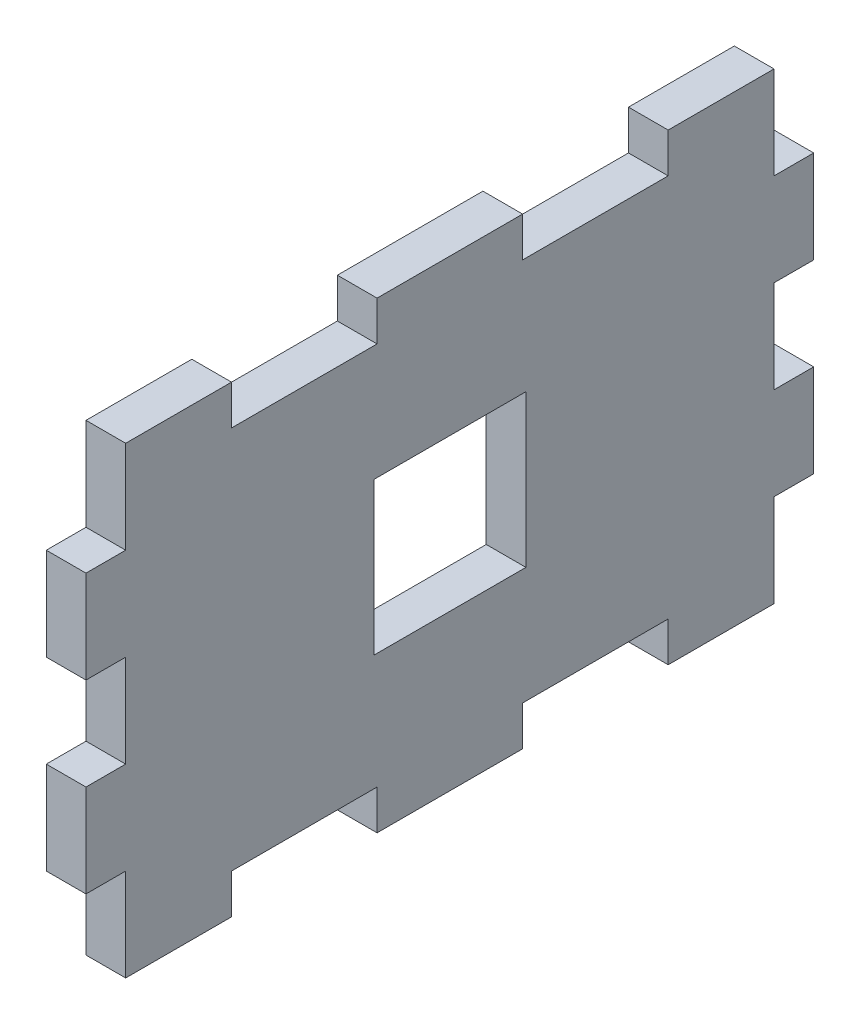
ISO-10303-21;
HEADER;
FILE_DESCRIPTION(('STEP AP214'),'2;1');
FILE_NAME('part.step','',(''),(''),'','','');
FILE_SCHEMA(('AUTOMOTIVE_DESIGN { 1 0 10303 214 1 1 1 1 }'));
ENDSEC;
DATA;
#1=APPLICATION_CONTEXT('core data for automotive mechanical design processes');
#2=APPLICATION_PROTOCOL_DEFINITION('international standard','automotive_design',2000,#1);
#3=PRODUCT_CONTEXT('',#1,'mechanical');
#4=PRODUCT('Part','Part','',(#3));
#5=PRODUCT_RELATED_PRODUCT_CATEGORY('part','',(#4));
#6=PRODUCT_DEFINITION_FORMATION('','',#4);
#7=PRODUCT_DEFINITION_CONTEXT('part definition',#1,'design');
#8=PRODUCT_DEFINITION('design','',#6,#7);
#9=PRODUCT_DEFINITION_SHAPE('','',#8);
#10=(LENGTH_UNIT() NAMED_UNIT(*) SI_UNIT(.MILLI.,.METRE.));
#11=(NAMED_UNIT(*) PLANE_ANGLE_UNIT() SI_UNIT($,.RADIAN.));
#12=(NAMED_UNIT(*) SI_UNIT($,.STERADIAN.) SOLID_ANGLE_UNIT());
#13=UNCERTAINTY_MEASURE_WITH_UNIT(LENGTH_MEASURE(1.E-05),#10,'distance_accuracy_value','');
#14=(GEOMETRIC_REPRESENTATION_CONTEXT(3) GLOBAL_UNCERTAINTY_ASSIGNED_CONTEXT((#13)) GLOBAL_UNIT_ASSIGNED_CONTEXT((#10,
#11,#12)) REPRESENTATION_CONTEXT('',''));
#15=CARTESIAN_POINT('',(0.,0.,0.));
#16=DIRECTION('',(0.,0.,1.));
#17=DIRECTION('',(1.,0.,0.));
#18=AXIS2_PLACEMENT_3D('',#15,#16,#17);
#19=CARTESIAN_POINT('',(3.,0.,0.));
#20=DIRECTION('',(1.,0.,0.));
#21=DIRECTION('',(0.,0.,-1.));
#22=AXIS2_PLACEMENT_3D('',#19,#20,#21);
#23=PLANE('',#22);
#24=DIRECTION('',(0.,1.,0.));
#25=VECTOR('',#24,1.);
#26=CARTESIAN_POINT('',(3.,5.75,-5.75));
#27=LINE('',#26,#25);
#28=CARTESIAN_POINT('',(3.,-5.75,-5.75));
#29=VERTEX_POINT('',#28);
#30=CARTESIAN_POINT('',(3.,5.75,-5.75));
#31=VERTEX_POINT('',#30);
#32=EDGE_CURVE('E49',#29,#31,#27,.T.);
#33=ORIENTED_EDGE('',*,*,#32,.F.);
#34=DIRECTION('',(0.,0.,-1.));
#35=VECTOR('',#34,1.);
#36=CARTESIAN_POINT('',(3.,-5.75,5.75));
#37=LINE('',#36,#35);
#38=CARTESIAN_POINT('',(3.,-5.75,5.75));
#39=VERTEX_POINT('',#38);
#40=EDGE_CURVE('E309',#39,#29,#37,.T.);
#41=ORIENTED_EDGE('',*,*,#40,.F.);
#42=DIRECTION('',(0.,-1.,0.));
#43=VECTOR('',#42,1.);
#44=CARTESIAN_POINT('',(3.,5.75,5.75));
#45=LINE('',#44,#43);
#46=CARTESIAN_POINT('',(3.,5.75,5.75));
#47=VERTEX_POINT('',#46);
#48=EDGE_CURVE('E294',#47,#39,#45,.T.);
#49=ORIENTED_EDGE('',*,*,#48,.F.);
#50=DIRECTION('',(0.,0.,1.));
#51=VECTOR('',#50,1.);
#52=CARTESIAN_POINT('',(3.,5.75,5.75));
#53=LINE('',#52,#51);
#54=EDGE_CURVE('E303',#31,#47,#53,.T.);
#55=ORIENTED_EDGE('',*,*,#54,.F.);
#56=EDGE_LOOP('',(#33,#41,#49,#55));
#57=FACE_BOUND('',#56,.T.);
#58=DIRECTION('',(0.,-1.,0.));
#59=VECTOR('',#58,1.);
#60=CARTESIAN_POINT('',(3.,0.,24.5));
#61=LINE('',#60,#59);
#62=CARTESIAN_POINT('',(3.,3.5,24.5));
#63=VERTEX_POINT('',#62);
#64=CARTESIAN_POINT('',(3.,-3.5,24.5));
#65=VERTEX_POINT('',#64);
#66=EDGE_CURVE('E333',#63,#65,#61,.T.);
#67=ORIENTED_EDGE('',*,*,#66,.T.);
#68=DIRECTION('',(0.,0.,1.));
#69=VECTOR('',#68,1.);
#70=CARTESIAN_POINT('',(3.,-3.5,0.));
#71=LINE('',#70,#69);
#72=CARTESIAN_POINT('',(3.,-3.5,27.5));
#73=VERTEX_POINT('',#72);
#74=EDGE_CURVE('E337',#65,#73,#71,.T.);
#75=ORIENTED_EDGE('',*,*,#74,.T.);
#76=DIRECTION('',(0.,-1.,0.));
#77=VECTOR('',#76,1.);
#78=CARTESIAN_POINT('',(3.,17.5,27.5));
#79=LINE('',#78,#77);
#80=CARTESIAN_POINT('',(3.,-10.5,27.5));
#81=VERTEX_POINT('',#80);
#82=EDGE_CURVE('E552',#73,#81,#79,.T.);
#83=ORIENTED_EDGE('',*,*,#82,.T.);
#84=DIRECTION('',(0.,0.,-1.));
#85=VECTOR('',#84,1.);
#86=CARTESIAN_POINT('',(3.,-10.5,0.));
#87=LINE('',#86,#85);
#88=CARTESIAN_POINT('',(3.,-10.5,24.5));
#89=VERTEX_POINT('',#88);
#90=EDGE_CURVE('E354',#81,#89,#87,.T.);
#91=ORIENTED_EDGE('',*,*,#90,.T.);
#92=DIRECTION('',(0.,-1.,0.));
#93=VECTOR('',#92,1.);
#94=CARTESIAN_POINT('',(3.,0.,24.5));
#95=LINE('',#94,#93);
#96=CARTESIAN_POINT('',(3.,-17.5,24.5));
#97=VERTEX_POINT('',#96);
#98=EDGE_CURVE('E329',#89,#97,#95,.T.);
#99=ORIENTED_EDGE('',*,*,#98,.T.);
#100=DIRECTION('',(0.,0.,-1.));
#101=VECTOR('',#100,1.);
#102=CARTESIAN_POINT('',(3.,-17.5,27.5));
#103=LINE('',#102,#101);
#104=CARTESIAN_POINT('',(3.,-17.5,16.5));
#105=VERTEX_POINT('',#104);
#106=EDGE_CURVE('E559',#97,#105,#103,.T.);
#107=ORIENTED_EDGE('',*,*,#106,.T.);
#108=DIRECTION('',(0.,1.,0.));
#109=VECTOR('',#108,1.);
#110=CARTESIAN_POINT('',(3.,0.,16.5));
#111=LINE('',#110,#109);
#112=CARTESIAN_POINT('',(3.,-14.5,16.5));
#113=VERTEX_POINT('',#112);
#114=EDGE_CURVE('E434',#105,#113,#111,.T.);
#115=ORIENTED_EDGE('',*,*,#114,.T.);
#116=DIRECTION('',(0.,0.,-1.));
#117=VECTOR('',#116,1.);
#118=CARTESIAN_POINT('',(3.,-14.5,0.));
#119=LINE('',#118,#117);
#120=CARTESIAN_POINT('',(3.,-14.5,5.5));
#121=VERTEX_POINT('',#120);
#122=EDGE_CURVE('E497',#113,#121,#119,.T.);
#123=ORIENTED_EDGE('',*,*,#122,.T.);
#124=DIRECTION('',(0.,-1.,0.));
#125=VECTOR('',#124,1.);
#126=CARTESIAN_POINT('',(3.,0.,5.5));
#127=LINE('',#126,#125);
#128=CARTESIAN_POINT('',(3.,-17.5,5.5));
#129=VERTEX_POINT('',#128);
#130=EDGE_CURVE('E505',#121,#129,#127,.T.);
#131=ORIENTED_EDGE('',*,*,#130,.T.);
#132=CARTESIAN_POINT('',(3.,-17.5,-5.5));
#133=VERTEX_POINT('',#132);
#134=EDGE_CURVE('E562',#129,#133,#103,.T.);
#135=ORIENTED_EDGE('',*,*,#134,.T.);
#136=DIRECTION('',(0.,1.,0.));
#137=VECTOR('',#136,1.);
#138=CARTESIAN_POINT('',(3.,0.,-5.5));
#139=LINE('',#138,#137);
#140=CARTESIAN_POINT('',(3.,-14.5,-5.5));
#141=VERTEX_POINT('',#140);
#142=EDGE_CURVE('E477',#133,#141,#139,.T.);
#143=ORIENTED_EDGE('',*,*,#142,.T.);
#144=DIRECTION('',(0.,0.,-1.));
#145=VECTOR('',#144,1.);
#146=CARTESIAN_POINT('',(3.,-14.5,0.));
#147=LINE('',#146,#145);
#148=CARTESIAN_POINT('',(3.,-14.5,-16.5));
#149=VERTEX_POINT('',#148);
#150=EDGE_CURVE('E471',#141,#149,#147,.T.);
#151=ORIENTED_EDGE('',*,*,#150,.T.);
#152=DIRECTION('',(0.,-1.,0.));
#153=VECTOR('',#152,1.);
#154=CARTESIAN_POINT('',(3.,0.,-16.5));
#155=LINE('',#154,#153);
#156=CARTESIAN_POINT('',(3.,-17.5,-16.5));
#157=VERTEX_POINT('',#156);
#158=EDGE_CURVE('E480',#149,#157,#155,.T.);
#159=ORIENTED_EDGE('',*,*,#158,.T.);
#160=CARTESIAN_POINT('',(3.,-17.5,-24.5));
#161=VERTEX_POINT('',#160);
#162=EDGE_CURVE('E558',#157,#161,#103,.T.);
#163=ORIENTED_EDGE('',*,*,#162,.T.);
#164=DIRECTION('',(0.,-1.,0.));
#165=VECTOR('',#164,1.);
#166=CARTESIAN_POINT('',(3.,0.,-24.5));
#167=LINE('',#166,#165);
#168=CARTESIAN_POINT('',(3.,-10.5,-24.5));
#169=VERTEX_POINT('',#168);
#170=EDGE_CURVE('E413',#169,#161,#167,.T.);
#171=ORIENTED_EDGE('',*,*,#170,.F.);
#172=DIRECTION('',(0.,0.,1.));
#173=VECTOR('',#172,1.);
#174=CARTESIAN_POINT('',(3.,-10.5,0.));
#175=LINE('',#174,#173);
#176=CARTESIAN_POINT('',(3.,-10.5,-27.5));
#177=VERTEX_POINT('',#176);
#178=EDGE_CURVE('E390',#177,#169,#175,.T.);
#179=ORIENTED_EDGE('',*,*,#178,.F.);
#180=DIRECTION('',(0.,1.,0.));
#181=VECTOR('',#180,1.);
#182=CARTESIAN_POINT('',(3.,17.5,-27.5));
#183=LINE('',#182,#181);
#184=CARTESIAN_POINT('',(3.,-3.5,-27.5));
#185=VERTEX_POINT('',#184);
#186=EDGE_CURVE('E548',#177,#185,#183,.T.);
#187=ORIENTED_EDGE('',*,*,#186,.T.);
#188=DIRECTION('',(0.,0.,-1.));
#189=VECTOR('',#188,1.);
#190=CARTESIAN_POINT('',(3.,-3.49999999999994,0.));
#191=LINE('',#190,#189);
#192=CARTESIAN_POINT('',(3.,-3.5,-24.5));
#193=VERTEX_POINT('',#192);
#194=EDGE_CURVE('E391',#193,#185,#191,.T.);
#195=ORIENTED_EDGE('',*,*,#194,.F.);
#196=DIRECTION('',(0.,-1.,0.));
#197=VECTOR('',#196,1.);
#198=CARTESIAN_POINT('',(3.,0.,-24.5));
#199=LINE('',#198,#197);
#200=CARTESIAN_POINT('',(3.,3.5,-24.5));
#201=VERTEX_POINT('',#200);
#202=EDGE_CURVE('E393',#201,#193,#199,.T.);
#203=ORIENTED_EDGE('',*,*,#202,.F.);
#204=DIRECTION('',(0.,0.,1.));
#205=VECTOR('',#204,1.);
#206=CARTESIAN_POINT('',(3.,3.50000000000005,0.));
#207=LINE('',#206,#205);
#208=CARTESIAN_POINT('',(3.,3.5,-27.5));
#209=VERTEX_POINT('',#208);
#210=EDGE_CURVE('E370',#209,#201,#207,.T.);
#211=ORIENTED_EDGE('',*,*,#210,.F.);
#212=CARTESIAN_POINT('',(3.,10.5,-27.5));
#213=VERTEX_POINT('',#212);
#214=EDGE_CURVE('E545',#209,#213,#183,.T.);
#215=ORIENTED_EDGE('',*,*,#214,.T.);
#216=DIRECTION('',(0.,0.,-1.));
#217=VECTOR('',#216,1.);
#218=CARTESIAN_POINT('',(3.,10.5,0.));
#219=LINE('',#218,#217);
#220=CARTESIAN_POINT('',(3.,10.5,-24.5));
#221=VERTEX_POINT('',#220);
#222=EDGE_CURVE('E371',#221,#213,#219,.T.);
#223=ORIENTED_EDGE('',*,*,#222,.F.);
#224=DIRECTION('',(0.,-1.,0.));
#225=VECTOR('',#224,1.);
#226=CARTESIAN_POINT('',(3.,0.,-24.5));
#227=LINE('',#226,#225);
#228=CARTESIAN_POINT('',(3.,17.5,-24.5));
#229=VERTEX_POINT('',#228);
#230=EDGE_CURVE('E353',#229,#221,#227,.T.);
#231=ORIENTED_EDGE('',*,*,#230,.F.);
#232=DIRECTION('',(0.,0.,1.));
#233=VECTOR('',#232,1.);
#234=CARTESIAN_POINT('',(3.,17.5,27.5));
#235=LINE('',#234,#233);
#236=CARTESIAN_POINT('',(3.,17.5,-16.5));
#237=VERTEX_POINT('',#236);
#238=EDGE_CURVE('E550',#229,#237,#235,.T.);
#239=ORIENTED_EDGE('',*,*,#238,.T.);
#240=DIRECTION('',(0.,1.,0.));
#241=VECTOR('',#240,1.);
#242=CARTESIAN_POINT('',(3.,0.,-16.5));
#243=LINE('',#242,#241);
#244=CARTESIAN_POINT('',(3.,14.5,-16.5));
#245=VERTEX_POINT('',#244);
#246=EDGE_CURVE('E453',#245,#237,#243,.T.);
#247=ORIENTED_EDGE('',*,*,#246,.F.);
#248=DIRECTION('',(0.,0.,-1.));
#249=VECTOR('',#248,1.);
#250=CARTESIAN_POINT('',(3.,14.5,0.));
#251=LINE('',#250,#249);
#252=CARTESIAN_POINT('',(3.,14.5,-5.5));
#253=VERTEX_POINT('',#252);
#254=EDGE_CURVE('E450',#253,#245,#251,.T.);
#255=ORIENTED_EDGE('',*,*,#254,.F.);
#256=DIRECTION('',(0.,-1.,0.));
#257=VECTOR('',#256,1.);
#258=CARTESIAN_POINT('',(3.,0.,-5.5));
#259=LINE('',#258,#257);
#260=CARTESIAN_POINT('',(3.,17.5,-5.5));
#261=VERTEX_POINT('',#260);
#262=EDGE_CURVE('E443',#261,#253,#259,.T.);
#263=ORIENTED_EDGE('',*,*,#262,.F.);
#264=CARTESIAN_POINT('',(3.,17.5,5.5));
#265=VERTEX_POINT('',#264);
#266=EDGE_CURVE('E553',#261,#265,#235,.T.);
#267=ORIENTED_EDGE('',*,*,#266,.T.);
#268=DIRECTION('',(0.,1.,0.));
#269=VECTOR('',#268,1.);
#270=CARTESIAN_POINT('',(3.,0.,5.5));
#271=LINE('',#270,#269);
#272=CARTESIAN_POINT('',(3.,14.5,5.5));
#273=VERTEX_POINT('',#272);
#274=EDGE_CURVE('E531',#273,#265,#271,.T.);
#275=ORIENTED_EDGE('',*,*,#274,.F.);
#276=DIRECTION('',(0.,0.,-1.));
#277=VECTOR('',#276,1.);
#278=CARTESIAN_POINT('',(3.,14.5,0.));
#279=LINE('',#278,#277);
#280=CARTESIAN_POINT('',(3.,14.5,16.5));
#281=VERTEX_POINT('',#280);
#282=EDGE_CURVE('E461',#281,#273,#279,.T.);
#283=ORIENTED_EDGE('',*,*,#282,.F.);
#284=DIRECTION('',(0.,-1.,0.));
#285=VECTOR('',#284,1.);
#286=CARTESIAN_POINT('',(3.,0.,16.5));
#287=LINE('',#286,#285);
#288=CARTESIAN_POINT('',(3.,17.5,16.5));
#289=VERTEX_POINT('',#288);
#290=EDGE_CURVE('E522',#289,#281,#287,.T.);
#291=ORIENTED_EDGE('',*,*,#290,.F.);
#292=CARTESIAN_POINT('',(3.,17.5,24.5));
#293=VERTEX_POINT('',#292);
#294=EDGE_CURVE('E554',#289,#293,#235,.T.);
#295=ORIENTED_EDGE('',*,*,#294,.T.);
#296=DIRECTION('',(0.,-1.,0.));
#297=VECTOR('',#296,1.);
#298=CARTESIAN_POINT('',(3.,0.,24.5));
#299=LINE('',#298,#297);
#300=CARTESIAN_POINT('',(3.,10.5,24.5));
#301=VERTEX_POINT('',#300);
#302=EDGE_CURVE('E425',#293,#301,#299,.T.);
#303=ORIENTED_EDGE('',*,*,#302,.T.);
#304=DIRECTION('',(0.,0.,1.));
#305=VECTOR('',#304,1.);
#306=CARTESIAN_POINT('',(3.,10.5,0.));
#307=LINE('',#306,#305);
#308=CARTESIAN_POINT('',(3.,10.5,27.5));
#309=VERTEX_POINT('',#308);
#310=EDGE_CURVE('E340',#301,#309,#307,.T.);
#311=ORIENTED_EDGE('',*,*,#310,.T.);
#312=CARTESIAN_POINT('',(3.,3.5,27.5));
#313=VERTEX_POINT('',#312);
#314=EDGE_CURVE('E555',#309,#313,#79,.T.);
#315=ORIENTED_EDGE('',*,*,#314,.T.);
#316=DIRECTION('',(0.,0.,-1.));
#317=VECTOR('',#316,1.);
#318=CARTESIAN_POINT('',(3.,3.5,0.));
#319=LINE('',#318,#317);
#320=EDGE_CURVE('E330',#313,#63,#319,.T.);
#321=ORIENTED_EDGE('',*,*,#320,.T.);
#322=EDGE_LOOP('',(#67,#75,#83,#91,#99,#107,#115,#123,#131,#135,#143,#151,#159,#163,#171,#179,
#187,#195,#203,#211,#215,#223,#231,#239,#247,#255,#263,#267,#275,#283,#291,#295,#303,#311,#315,#321));
#323=FACE_BOUND('',#322,.T.);
#324=ADVANCED_FACE('F34',(#57,#323),#23,.T.);
#325=CARTESIAN_POINT('',(0.,0.,0.));
#326=DIRECTION('',(1.,0.,0.));
#327=DIRECTION('',(0.,0.,-1.));
#328=AXIS2_PLACEMENT_3D('',#325,#326,#327);
#329=PLANE('',#328);
#330=DIRECTION('',(0.,0.,-1.));
#331=VECTOR('',#330,1.);
#332=CARTESIAN_POINT('',(0.,-5.75,0.));
#333=LINE('',#332,#331);
#334=CARTESIAN_POINT('',(0.,-5.75,5.75));
#335=VERTEX_POINT('',#334);
#336=CARTESIAN_POINT('',(0.,-5.75,-5.75));
#337=VERTEX_POINT('',#336);
#338=EDGE_CURVE('E42',#335,#337,#333,.T.);
#339=ORIENTED_EDGE('',*,*,#338,.T.);
#340=DIRECTION('',(0.,1.,0.));
#341=VECTOR('',#340,1.);
#342=CARTESIAN_POINT('',(0.,0.,-5.75));
#343=LINE('',#342,#341);
#344=CARTESIAN_POINT('',(0.,5.75,-5.75));
#345=VERTEX_POINT('',#344);
#346=EDGE_CURVE('E12',#337,#345,#343,.T.);
#347=ORIENTED_EDGE('',*,*,#346,.T.);
#348=DIRECTION('',(0.,0.,1.));
#349=VECTOR('',#348,1.);
#350=CARTESIAN_POINT('',(0.,5.75,0.));
#351=LINE('',#350,#349);
#352=CARTESIAN_POINT('',(0.,5.75,5.75));
#353=VERTEX_POINT('',#352);
#354=EDGE_CURVE('E561',#345,#353,#351,.T.);
#355=ORIENTED_EDGE('',*,*,#354,.T.);
#356=DIRECTION('',(0.,-1.,0.));
#357=VECTOR('',#356,1.);
#358=CARTESIAN_POINT('',(0.,0.,5.75));
#359=LINE('',#358,#357);
#360=EDGE_CURVE('E297',#353,#335,#359,.T.);
#361=ORIENTED_EDGE('',*,*,#360,.T.);
#362=EDGE_LOOP('',(#339,#347,#355,#361));
#363=FACE_BOUND('',#362,.T.);
#364=DIRECTION('',(0.,0.,1.));
#365=VECTOR('',#364,1.);
#366=CARTESIAN_POINT('',(0.,-3.5,0.));
#367=LINE('',#366,#365);
#368=CARTESIAN_POINT('',(0.,-3.5,24.5));
#369=VERTEX_POINT('',#368);
#370=CARTESIAN_POINT('',(0.,-3.5,27.5));
#371=VERTEX_POINT('',#370);
#372=EDGE_CURVE('E334',#369,#371,#367,.T.);
#373=ORIENTED_EDGE('',*,*,#372,.F.);
#374=DIRECTION('',(0.,-1.,0.));
#375=VECTOR('',#374,1.);
#376=CARTESIAN_POINT('',(0.,0.,24.5));
#377=LINE('',#376,#375);
#378=CARTESIAN_POINT('',(0.,3.5,24.5));
#379=VERTEX_POINT('',#378);
#380=EDGE_CURVE('E342',#379,#369,#377,.T.);
#381=ORIENTED_EDGE('',*,*,#380,.F.);
#382=DIRECTION('',(0.,0.,-1.));
#383=VECTOR('',#382,1.);
#384=CARTESIAN_POINT('',(0.,3.5,0.));
#385=LINE('',#384,#383);
#386=CARTESIAN_POINT('',(0.,3.5,27.5));
#387=VERTEX_POINT('',#386);
#388=EDGE_CURVE('E321',#387,#379,#385,.T.);
#389=ORIENTED_EDGE('',*,*,#388,.F.);
#390=DIRECTION('',(0.,-1.,0.));
#391=VECTOR('',#390,1.);
#392=CARTESIAN_POINT('',(0.,17.5,27.5));
#393=LINE('',#392,#391);
#394=CARTESIAN_POINT('',(0.,10.5,27.5));
#395=VERTEX_POINT('',#394);
#396=EDGE_CURVE('E571',#395,#387,#393,.T.);
#397=ORIENTED_EDGE('',*,*,#396,.F.);
#398=DIRECTION('',(0.,0.,1.));
#399=VECTOR('',#398,1.);
#400=CARTESIAN_POINT('',(0.,10.5,0.));
#401=LINE('',#400,#399);
#402=CARTESIAN_POINT('',(0.,10.5,24.5));
#403=VERTEX_POINT('',#402);
#404=EDGE_CURVE('E422',#403,#395,#401,.T.);
#405=ORIENTED_EDGE('',*,*,#404,.F.);
#406=DIRECTION('',(0.,-1.,0.));
#407=VECTOR('',#406,1.);
#408=CARTESIAN_POINT('',(0.,0.,24.5));
#409=LINE('',#408,#407);
#410=CARTESIAN_POINT('',(0.,17.5,24.5));
#411=VERTEX_POINT('',#410);
#412=EDGE_CURVE('E424',#411,#403,#409,.T.);
#413=ORIENTED_EDGE('',*,*,#412,.F.);
#414=DIRECTION('',(0.,0.,1.));
#415=VECTOR('',#414,1.);
#416=CARTESIAN_POINT('',(0.,17.5,27.5));
#417=LINE('',#416,#415);
#418=CARTESIAN_POINT('',(0.,17.5,16.5));
#419=VERTEX_POINT('',#418);
#420=EDGE_CURVE('E570',#419,#411,#417,.T.);
#421=ORIENTED_EDGE('',*,*,#420,.F.);
#422=DIRECTION('',(0.,-1.,0.));
#423=VECTOR('',#422,1.);
#424=CARTESIAN_POINT('',(0.,0.,16.5));
#425=LINE('',#424,#423);
#426=CARTESIAN_POINT('',(0.,14.5,16.5));
#427=VERTEX_POINT('',#426);
#428=EDGE_CURVE('E525',#419,#427,#425,.T.);
#429=ORIENTED_EDGE('',*,*,#428,.T.);
#430=DIRECTION('',(0.,0.,-1.));
#431=VECTOR('',#430,1.);
#432=CARTESIAN_POINT('',(0.,14.5,0.));
#433=LINE('',#432,#431);
#434=CARTESIAN_POINT('',(0.,14.5,5.5));
#435=VERTEX_POINT('',#434);
#436=EDGE_CURVE('E518',#427,#435,#433,.T.);
#437=ORIENTED_EDGE('',*,*,#436,.T.);
#438=DIRECTION('',(0.,1.,0.));
#439=VECTOR('',#438,1.);
#440=CARTESIAN_POINT('',(0.,0.,5.5));
#441=LINE('',#440,#439);
#442=CARTESIAN_POINT('',(0.,17.5,5.5));
#443=VERTEX_POINT('',#442);
#444=EDGE_CURVE('E521',#435,#443,#441,.T.);
#445=ORIENTED_EDGE('',*,*,#444,.T.);
#446=CARTESIAN_POINT('',(0.,17.5,-5.5));
#447=VERTEX_POINT('',#446);
#448=EDGE_CURVE('E569',#447,#443,#417,.T.);
#449=ORIENTED_EDGE('',*,*,#448,.F.);
#450=DIRECTION('',(0.,-1.,0.));
#451=VECTOR('',#450,1.);
#452=CARTESIAN_POINT('',(0.,0.,-5.5));
#453=LINE('',#452,#451);
#454=CARTESIAN_POINT('',(0.,14.5,-5.5));
#455=VERTEX_POINT('',#454);
#456=EDGE_CURVE('E446',#447,#455,#453,.T.);
#457=ORIENTED_EDGE('',*,*,#456,.T.);
#458=DIRECTION('',(0.,0.,-1.));
#459=VECTOR('',#458,1.);
#460=CARTESIAN_POINT('',(0.,14.5,0.));
#461=LINE('',#460,#459);
#462=CARTESIAN_POINT('',(0.,14.5,-16.5));
#463=VERTEX_POINT('',#462);
#464=EDGE_CURVE('E439',#455,#463,#461,.T.);
#465=ORIENTED_EDGE('',*,*,#464,.T.);
#466=DIRECTION('',(0.,1.,0.));
#467=VECTOR('',#466,1.);
#468=CARTESIAN_POINT('',(0.,0.,-16.5));
#469=LINE('',#468,#467);
#470=CARTESIAN_POINT('',(0.,17.5,-16.5));
#471=VERTEX_POINT('',#470);
#472=EDGE_CURVE('E442',#463,#471,#469,.T.);
#473=ORIENTED_EDGE('',*,*,#472,.T.);
#474=CARTESIAN_POINT('',(0.,17.5,-24.5));
#475=VERTEX_POINT('',#474);
#476=EDGE_CURVE('E566',#475,#471,#417,.T.);
#477=ORIENTED_EDGE('',*,*,#476,.F.);
#478=DIRECTION('',(0.,-1.,0.));
#479=VECTOR('',#478,1.);
#480=CARTESIAN_POINT('',(0.,0.,-24.5));
#481=LINE('',#480,#479);
#482=CARTESIAN_POINT('',(0.,10.5,-24.5));
#483=VERTEX_POINT('',#482);
#484=EDGE_CURVE('E373',#475,#483,#481,.T.);
#485=ORIENTED_EDGE('',*,*,#484,.T.);
#486=DIRECTION('',(0.,0.,-1.));
#487=VECTOR('',#486,1.);
#488=CARTESIAN_POINT('',(0.,10.5,0.));
#489=LINE('',#488,#487);
#490=CARTESIAN_POINT('',(0.,10.5,-27.5));
#491=VERTEX_POINT('',#490);
#492=EDGE_CURVE('E364',#483,#491,#489,.T.);
#493=ORIENTED_EDGE('',*,*,#492,.T.);
#494=DIRECTION('',(0.,1.,0.));
#495=VECTOR('',#494,1.);
#496=CARTESIAN_POINT('',(0.,17.5,-27.5));
#497=LINE('',#496,#495);
#498=CARTESIAN_POINT('',(0.,3.5,-27.5));
#499=VERTEX_POINT('',#498);
#500=EDGE_CURVE('E538',#499,#491,#497,.T.);
#501=ORIENTED_EDGE('',*,*,#500,.F.);
#502=DIRECTION('',(0.,0.,1.));
#503=VECTOR('',#502,1.);
#504=CARTESIAN_POINT('',(0.,3.50000000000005,0.));
#505=LINE('',#504,#503);
#506=CARTESIAN_POINT('',(0.,3.5,-24.5));
#507=VERTEX_POINT('',#506);
#508=EDGE_CURVE('E394',#499,#507,#505,.T.);
#509=ORIENTED_EDGE('',*,*,#508,.T.);
#510=DIRECTION('',(0.,-1.,0.));
#511=VECTOR('',#510,1.);
#512=CARTESIAN_POINT('',(0.,0.,-24.5));
#513=LINE('',#512,#511);
#514=CARTESIAN_POINT('',(0.,-3.5,-24.5));
#515=VERTEX_POINT('',#514);
#516=EDGE_CURVE('E401',#507,#515,#513,.T.);
#517=ORIENTED_EDGE('',*,*,#516,.T.);
#518=DIRECTION('',(0.,0.,-1.));
#519=VECTOR('',#518,1.);
#520=CARTESIAN_POINT('',(0.,-3.49999999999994,0.));
#521=LINE('',#520,#519);
#522=CARTESIAN_POINT('',(0.,-3.5,-27.5));
#523=VERTEX_POINT('',#522);
#524=EDGE_CURVE('E382',#515,#523,#521,.T.);
#525=ORIENTED_EDGE('',*,*,#524,.T.);
#526=CARTESIAN_POINT('',(0.,-10.5,-27.5));
#527=VERTEX_POINT('',#526);
#528=EDGE_CURVE('E565',#527,#523,#497,.T.);
#529=ORIENTED_EDGE('',*,*,#528,.F.);
#530=DIRECTION('',(0.,0.,1.));
#531=VECTOR('',#530,1.);
#532=CARTESIAN_POINT('',(0.,-10.5,0.));
#533=LINE('',#532,#531);
#534=CARTESIAN_POINT('',(0.,-10.5,-24.5));
#535=VERTEX_POINT('',#534);
#536=EDGE_CURVE('E415',#527,#535,#533,.T.);
#537=ORIENTED_EDGE('',*,*,#536,.T.);
#538=DIRECTION('',(0.,-1.,0.));
#539=VECTOR('',#538,1.);
#540=CARTESIAN_POINT('',(0.,0.,-24.5));
#541=LINE('',#540,#539);
#542=CARTESIAN_POINT('',(0.,-17.5,-24.5));
#543=VERTEX_POINT('',#542);
#544=EDGE_CURVE('E408',#535,#543,#541,.T.);
#545=ORIENTED_EDGE('',*,*,#544,.T.);
#546=DIRECTION('',(0.,0.,-1.));
#547=VECTOR('',#546,1.);
#548=CARTESIAN_POINT('',(0.,-17.5,27.5));
#549=LINE('',#548,#547);
#550=CARTESIAN_POINT('',(0.,-17.5,-16.5));
#551=VERTEX_POINT('',#550);
#552=EDGE_CURVE('E574',#551,#543,#549,.T.);
#553=ORIENTED_EDGE('',*,*,#552,.F.);
#554=DIRECTION('',(0.,-1.,0.));
#555=VECTOR('',#554,1.);
#556=CARTESIAN_POINT('',(0.,0.,-16.5));
#557=LINE('',#556,#555);
#558=CARTESIAN_POINT('',(0.,-14.5,-16.5));
#559=VERTEX_POINT('',#558);
#560=EDGE_CURVE('E470',#559,#551,#557,.T.);
#561=ORIENTED_EDGE('',*,*,#560,.F.);
#562=DIRECTION('',(0.,0.,-1.));
#563=VECTOR('',#562,1.);
#564=CARTESIAN_POINT('',(0.,-14.5,0.));
#565=LINE('',#564,#563);
#566=CARTESIAN_POINT('',(0.,-14.5,-5.5));
#567=VERTEX_POINT('',#566);
#568=EDGE_CURVE('E473',#567,#559,#565,.T.);
#569=ORIENTED_EDGE('',*,*,#568,.F.);
#570=DIRECTION('',(0.,1.,0.));
#571=VECTOR('',#570,1.);
#572=CARTESIAN_POINT('',(0.,0.,-5.5));
#573=LINE('',#572,#571);
#574=CARTESIAN_POINT('',(0.,-17.5,-5.5));
#575=VERTEX_POINT('',#574);
#576=EDGE_CURVE('E468',#575,#567,#573,.T.);
#577=ORIENTED_EDGE('',*,*,#576,.F.);
#578=CARTESIAN_POINT('',(0.,-17.5,5.5));
#579=VERTEX_POINT('',#578);
#580=EDGE_CURVE('E576',#579,#575,#549,.T.);
#581=ORIENTED_EDGE('',*,*,#580,.F.);
#582=DIRECTION('',(0.,-1.,0.));
#583=VECTOR('',#582,1.);
#584=CARTESIAN_POINT('',(0.,0.,5.5));
#585=LINE('',#584,#583);
#586=CARTESIAN_POINT('',(0.,-14.5,5.5));
#587=VERTEX_POINT('',#586);
#588=EDGE_CURVE('E496',#587,#579,#585,.T.);
#589=ORIENTED_EDGE('',*,*,#588,.F.);
#590=DIRECTION('',(0.,0.,-1.));
#591=VECTOR('',#590,1.);
#592=CARTESIAN_POINT('',(0.,-14.5,0.));
#593=LINE('',#592,#591);
#594=CARTESIAN_POINT('',(0.,-14.5,16.5));
#595=VERTEX_POINT('',#594);
#596=EDGE_CURVE('E499',#595,#587,#593,.T.);
#597=ORIENTED_EDGE('',*,*,#596,.F.);
#598=DIRECTION('',(0.,1.,0.));
#599=VECTOR('',#598,1.);
#600=CARTESIAN_POINT('',(0.,0.,16.5));
#601=LINE('',#600,#599);
#602=CARTESIAN_POINT('',(0.,-17.5,16.5));
#603=VERTEX_POINT('',#602);
#604=EDGE_CURVE('E494',#603,#595,#601,.T.);
#605=ORIENTED_EDGE('',*,*,#604,.F.);
#606=CARTESIAN_POINT('',(0.,-17.5,24.5));
#607=VERTEX_POINT('',#606);
#608=EDGE_CURVE('E549',#607,#603,#549,.T.);
#609=ORIENTED_EDGE('',*,*,#608,.F.);
#610=DIRECTION('',(0.,-1.,0.));
#611=VECTOR('',#610,1.);
#612=CARTESIAN_POINT('',(0.,0.,24.5));
#613=LINE('',#612,#611);
#614=CARTESIAN_POINT('',(0.,-10.5,24.5));
#615=VERTEX_POINT('',#614);
#616=EDGE_CURVE('E357',#615,#607,#613,.T.);
#617=ORIENTED_EDGE('',*,*,#616,.F.);
#618=DIRECTION('',(0.,0.,-1.));
#619=VECTOR('',#618,1.);
#620=CARTESIAN_POINT('',(0.,-10.5,0.));
#621=LINE('',#620,#619);
#622=CARTESIAN_POINT('',(0.,-10.5,27.5));
#623=VERTEX_POINT('',#622);
#624=EDGE_CURVE('E347',#623,#615,#621,.T.);
#625=ORIENTED_EDGE('',*,*,#624,.F.);
#626=EDGE_CURVE('E568',#371,#623,#393,.T.);
#627=ORIENTED_EDGE('',*,*,#626,.F.);
#628=EDGE_LOOP('',(#373,#381,#389,#397,#405,#413,#421,#429,#437,#445,#449,#457,#465,#473,#477,
#485,#493,#501,#509,#517,#525,#529,#537,#545,#553,#561,#569,#577,#581,#589,#597,#605,#609,#617,
#625,#627));
#629=FACE_BOUND('',#628,.T.);
#630=ADVANCED_FACE('F580',(#363,#629),#329,.F.);
#631=CARTESIAN_POINT('',(3.,17.5,27.5));
#632=DIRECTION('',(0.,0.,-1.));
#633=DIRECTION('',(0.,1.,0.));
#634=AXIS2_PLACEMENT_3D('',#631,#632,#633);
#635=PLANE('',#634);
#636=DIRECTION('',(1.,0.,0.));
#637=VECTOR('',#636,1.);
#638=CARTESIAN_POINT('',(0.,-3.5,27.5));
#639=LINE('',#638,#637);
#640=EDGE_CURVE('E327',#371,#73,#639,.T.);
#641=ORIENTED_EDGE('',*,*,#640,.F.);
#642=ORIENTED_EDGE('',*,*,#626,.T.);
#643=DIRECTION('',(1.,0.,0.));
#644=VECTOR('',#643,1.);
#645=CARTESIAN_POINT('',(0.,-10.5,27.5));
#646=LINE('',#645,#644);
#647=EDGE_CURVE('E348',#623,#81,#646,.T.);
#648=ORIENTED_EDGE('',*,*,#647,.T.);
#649=ORIENTED_EDGE('',*,*,#82,.F.);
#650=EDGE_LOOP('',(#641,#642,#648,#649));
#651=FACE_BOUND('',#650,.T.);
#652=ADVANCED_FACE('F605',(#651),#635,.F.);
#653=DIRECTION('',(1.,0.,0.));
#654=VECTOR('',#653,1.);
#655=CARTESIAN_POINT('',(0.,3.5,27.5));
#656=LINE('',#655,#654);
#657=EDGE_CURVE('E324',#387,#313,#656,.T.);
#658=ORIENTED_EDGE('',*,*,#657,.T.);
#659=ORIENTED_EDGE('',*,*,#314,.F.);
#660=DIRECTION('',(1.,0.,0.));
#661=VECTOR('',#660,1.);
#662=CARTESIAN_POINT('',(0.,10.5,27.5));
#663=LINE('',#662,#661);
#664=EDGE_CURVE('E432',#395,#309,#663,.T.);
#665=ORIENTED_EDGE('',*,*,#664,.F.);
#666=ORIENTED_EDGE('',*,*,#396,.T.);
#667=EDGE_LOOP('',(#658,#659,#665,#666));
#668=FACE_BOUND('',#667,.T.);
#669=ADVANCED_FACE('F619',(#668),#635,.F.);
#670=CARTESIAN_POINT('',(3.,-17.5,27.5));
#671=DIRECTION('',(0.,1.,0.));
#672=DIRECTION('',(0.,0.,1.));
#673=AXIS2_PLACEMENT_3D('',#670,#671,#672);
#674=PLANE('',#673);
#675=DIRECTION('',(1.,0.,0.));
#676=VECTOR('',#675,1.);
#677=CARTESIAN_POINT('',(0.,-17.5,24.5));
#678=LINE('',#677,#676);
#679=EDGE_CURVE('E351',#607,#97,#678,.T.);
#680=ORIENTED_EDGE('',*,*,#679,.F.);
#681=ORIENTED_EDGE('',*,*,#608,.T.);
#682=DIRECTION('',(1.,0.,0.));
#683=VECTOR('',#682,1.);
#684=CARTESIAN_POINT('',(0.,-17.5,16.5));
#685=LINE('',#684,#683);
#686=EDGE_CURVE('E502',#603,#105,#685,.T.);
#687=ORIENTED_EDGE('',*,*,#686,.T.);
#688=ORIENTED_EDGE('',*,*,#106,.F.);
#689=EDGE_LOOP('',(#680,#681,#687,#688));
#690=FACE_BOUND('',#689,.T.);
#691=ADVANCED_FACE('F617',(#690),#674,.F.);
#692=CARTESIAN_POINT('',(3.,17.5,-27.5));
#693=DIRECTION('',(0.,0.,1.));
#694=DIRECTION('',(0.,-1.,0.));
#695=AXIS2_PLACEMENT_3D('',#692,#693,#694);
#696=PLANE('',#695);
#697=ORIENTED_EDGE('',*,*,#528,.T.);
#698=DIRECTION('',(1.,0.,0.));
#699=VECTOR('',#698,1.);
#700=CARTESIAN_POINT('',(0.,-3.5,-27.5));
#701=LINE('',#700,#699);
#702=EDGE_CURVE('E387',#523,#185,#701,.T.);
#703=ORIENTED_EDGE('',*,*,#702,.T.);
#704=ORIENTED_EDGE('',*,*,#186,.F.);
#705=DIRECTION('',(1.,0.,0.));
#706=VECTOR('',#705,1.);
#707=CARTESIAN_POINT('',(0.,-10.5,-27.5));
#708=LINE('',#707,#706);
#709=EDGE_CURVE('E406',#527,#177,#708,.T.);
#710=ORIENTED_EDGE('',*,*,#709,.F.);
#711=EDGE_LOOP('',(#697,#703,#704,#710));
#712=FACE_BOUND('',#711,.T.);
#713=ADVANCED_FACE('F632',(#712),#696,.F.);
#714=CARTESIAN_POINT('',(3.,17.5,27.5));
#715=DIRECTION('',(0.,-1.,0.));
#716=DIRECTION('',(0.,0.,-1.));
#717=AXIS2_PLACEMENT_3D('',#714,#715,#716);
#718=PLANE('',#717);
#719=DIRECTION('',(1.,0.,0.));
#720=VECTOR('',#719,1.);
#721=CARTESIAN_POINT('',(0.,17.5,24.5));
#722=LINE('',#721,#720);
#723=EDGE_CURVE('E435',#411,#293,#722,.T.);
#724=ORIENTED_EDGE('',*,*,#723,.T.);
#725=ORIENTED_EDGE('',*,*,#294,.F.);
#726=DIRECTION('',(1.,0.,0.));
#727=VECTOR('',#726,1.);
#728=CARTESIAN_POINT('',(0.,17.5,16.5));
#729=LINE('',#728,#727);
#730=EDGE_CURVE('E539',#419,#289,#729,.T.);
#731=ORIENTED_EDGE('',*,*,#730,.F.);
#732=ORIENTED_EDGE('',*,*,#420,.T.);
#733=EDGE_LOOP('',(#724,#725,#731,#732));
#734=FACE_BOUND('',#733,.T.);
#735=ADVANCED_FACE('F624',(#734),#718,.F.);
#736=ORIENTED_EDGE('',*,*,#266,.F.);
#737=DIRECTION('',(1.,0.,0.));
#738=VECTOR('',#737,1.);
#739=CARTESIAN_POINT('',(0.,17.5,-5.5));
#740=LINE('',#739,#738);
#741=EDGE_CURVE('E462',#447,#261,#740,.T.);
#742=ORIENTED_EDGE('',*,*,#741,.F.);
#743=ORIENTED_EDGE('',*,*,#448,.T.);
#744=DIRECTION('',(1.,0.,0.));
#745=VECTOR('',#744,1.);
#746=CARTESIAN_POINT('',(0.,17.5,5.5));
#747=LINE('',#746,#745);
#748=EDGE_CURVE('E541',#443,#265,#747,.T.);
#749=ORIENTED_EDGE('',*,*,#748,.T.);
#750=EDGE_LOOP('',(#736,#742,#743,#749));
#751=FACE_BOUND('',#750,.T.);
#752=ADVANCED_FACE('F615',(#751),#718,.F.);
#753=DIRECTION('',(1.,0.,0.));
#754=VECTOR('',#753,1.);
#755=CARTESIAN_POINT('',(0.,-17.5,-5.5));
#756=LINE('',#755,#754);
#757=EDGE_CURVE('E476',#575,#133,#756,.T.);
#758=ORIENTED_EDGE('',*,*,#757,.T.);
#759=ORIENTED_EDGE('',*,*,#134,.F.);
#760=DIRECTION('',(1.,0.,0.));
#761=VECTOR('',#760,1.);
#762=CARTESIAN_POINT('',(0.,-17.5,5.5));
#763=LINE('',#762,#761);
#764=EDGE_CURVE('E514',#579,#129,#763,.T.);
#765=ORIENTED_EDGE('',*,*,#764,.F.);
#766=ORIENTED_EDGE('',*,*,#580,.T.);
#767=EDGE_LOOP('',(#758,#759,#765,#766));
#768=FACE_BOUND('',#767,.T.);
#769=ADVANCED_FACE('F611',(#768),#674,.F.);
#770=ORIENTED_EDGE('',*,*,#552,.T.);
#771=DIRECTION('',(1.,0.,0.));
#772=VECTOR('',#771,1.);
#773=CARTESIAN_POINT('',(0.,-17.5,-24.5));
#774=LINE('',#773,#772);
#775=EDGE_CURVE('E316',#543,#161,#774,.T.);
#776=ORIENTED_EDGE('',*,*,#775,.T.);
#777=ORIENTED_EDGE('',*,*,#162,.F.);
#778=DIRECTION('',(1.,0.,0.));
#779=VECTOR('',#778,1.);
#780=CARTESIAN_POINT('',(0.,-17.5,-16.5));
#781=LINE('',#780,#779);
#782=EDGE_CURVE('E490',#551,#157,#781,.T.);
#783=ORIENTED_EDGE('',*,*,#782,.F.);
#784=EDGE_LOOP('',(#770,#776,#777,#783));
#785=FACE_BOUND('',#784,.T.);
#786=ADVANCED_FACE('F614',(#785),#674,.F.);
#787=ORIENTED_EDGE('',*,*,#500,.T.);
#788=DIRECTION('',(1.,0.,0.));
#789=VECTOR('',#788,1.);
#790=CARTESIAN_POINT('',(0.,10.5,-27.5));
#791=LINE('',#790,#789);
#792=EDGE_CURVE('E367',#491,#213,#791,.T.);
#793=ORIENTED_EDGE('',*,*,#792,.T.);
#794=ORIENTED_EDGE('',*,*,#214,.F.);
#795=DIRECTION('',(1.,0.,0.));
#796=VECTOR('',#795,1.);
#797=CARTESIAN_POINT('',(0.,3.5,-27.5));
#798=LINE('',#797,#796);
#799=EDGE_CURVE('E380',#499,#209,#798,.T.);
#800=ORIENTED_EDGE('',*,*,#799,.F.);
#801=EDGE_LOOP('',(#787,#793,#794,#800));
#802=FACE_BOUND('',#801,.T.);
#803=ADVANCED_FACE('F36',(#802),#696,.F.);
#804=ORIENTED_EDGE('',*,*,#238,.F.);
#805=DIRECTION('',(1.,0.,0.));
#806=VECTOR('',#805,1.);
#807=CARTESIAN_POINT('',(0.,17.5,-24.5));
#808=LINE('',#807,#806);
#809=EDGE_CURVE('E362',#475,#229,#808,.T.);
#810=ORIENTED_EDGE('',*,*,#809,.F.);
#811=ORIENTED_EDGE('',*,*,#476,.T.);
#812=DIRECTION('',(1.,0.,0.));
#813=VECTOR('',#812,1.);
#814=CARTESIAN_POINT('',(0.,17.5,-16.5));
#815=LINE('',#814,#813);
#816=EDGE_CURVE('E464',#471,#237,#815,.T.);
#817=ORIENTED_EDGE('',*,*,#816,.T.);
#818=EDGE_LOOP('',(#804,#810,#811,#817));
#819=FACE_BOUND('',#818,.T.);
#820=ADVANCED_FACE('F621',(#819),#718,.F.);
#821=CARTESIAN_POINT('',(0.,14.5,0.));
#822=DIRECTION('',(0.,-1.,0.));
#823=DIRECTION('',(0.,0.,-1.));
#824=AXIS2_PLACEMENT_3D('',#821,#822,#823);
#825=PLANE('',#824);
#826=ORIENTED_EDGE('',*,*,#282,.T.);
#827=DIRECTION('',(1.,0.,0.));
#828=VECTOR('',#827,1.);
#829=CARTESIAN_POINT('',(0.,14.5,5.5));
#830=LINE('',#829,#828);
#831=EDGE_CURVE('E528',#435,#273,#830,.T.);
#832=ORIENTED_EDGE('',*,*,#831,.F.);
#833=ORIENTED_EDGE('',*,*,#436,.F.);
#834=DIRECTION('',(1.,0.,0.));
#835=VECTOR('',#834,1.);
#836=CARTESIAN_POINT('',(0.,14.5,16.5));
#837=LINE('',#836,#835);
#838=EDGE_CURVE('E536',#427,#281,#837,.T.);
#839=ORIENTED_EDGE('',*,*,#838,.T.);
#840=EDGE_LOOP('',(#826,#832,#833,#839));
#841=FACE_BOUND('',#840,.T.);
#842=ADVANCED_FACE('F608',(#841),#825,.F.);
#843=CARTESIAN_POINT('',(0.,0.,16.5));
#844=DIRECTION('',(0.,0.,1.));
#845=DIRECTION('',(0.,-1.,0.));
#846=AXIS2_PLACEMENT_3D('',#843,#844,#845);
#847=PLANE('',#846);
#848=ORIENTED_EDGE('',*,*,#290,.T.);
#849=ORIENTED_EDGE('',*,*,#838,.F.);
#850=ORIENTED_EDGE('',*,*,#428,.F.);
#851=ORIENTED_EDGE('',*,*,#730,.T.);
#852=EDGE_LOOP('',(#848,#849,#850,#851));
#853=FACE_BOUND('',#852,.T.);
#854=ADVANCED_FACE('F629',(#853),#847,.F.);
#855=CARTESIAN_POINT('',(0.,0.,5.5));
#856=DIRECTION('',(0.,0.,-1.));
#857=DIRECTION('',(-1.,0.,0.));
#858=AXIS2_PLACEMENT_3D('',#855,#856,#857);
#859=PLANE('',#858);
#860=ORIENTED_EDGE('',*,*,#274,.T.);
#861=ORIENTED_EDGE('',*,*,#748,.F.);
#862=ORIENTED_EDGE('',*,*,#444,.F.);
#863=ORIENTED_EDGE('',*,*,#831,.T.);
#864=EDGE_LOOP('',(#860,#861,#862,#863));
#865=FACE_BOUND('',#864,.T.);
#866=ADVANCED_FACE('F803',(#865),#859,.F.);
#867=CARTESIAN_POINT('',(0.,0.,16.5));
#868=DIRECTION('',(0.,0.,-1.));
#869=DIRECTION('',(0.,1.,0.));
#870=AXIS2_PLACEMENT_3D('',#867,#868,#869);
#871=PLANE('',#870);
#872=ORIENTED_EDGE('',*,*,#114,.F.);
#873=ORIENTED_EDGE('',*,*,#686,.F.);
#874=ORIENTED_EDGE('',*,*,#604,.T.);
#875=DIRECTION('',(1.,0.,0.));
#876=VECTOR('',#875,1.);
#877=CARTESIAN_POINT('',(0.,-14.5,16.5));
#878=LINE('',#877,#876);
#879=EDGE_CURVE('E481',#595,#113,#878,.T.);
#880=ORIENTED_EDGE('',*,*,#879,.T.);
#881=EDGE_LOOP('',(#872,#873,#874,#880));
#882=FACE_BOUND('',#881,.T.);
#883=ADVANCED_FACE('F737',(#882),#871,.T.);
#884=CARTESIAN_POINT('',(0.,-14.5,0.));
#885=DIRECTION('',(0.,-1.,0.));
#886=DIRECTION('',(0.,0.,-1.));
#887=AXIS2_PLACEMENT_3D('',#884,#885,#886);
#888=PLANE('',#887);
#889=ORIENTED_EDGE('',*,*,#122,.F.);
#890=ORIENTED_EDGE('',*,*,#879,.F.);
#891=ORIENTED_EDGE('',*,*,#596,.T.);
#892=DIRECTION('',(1.,0.,0.));
#893=VECTOR('',#892,1.);
#894=CARTESIAN_POINT('',(0.,-14.5,5.5));
#895=LINE('',#894,#893);
#896=EDGE_CURVE('E512',#587,#121,#895,.T.);
#897=ORIENTED_EDGE('',*,*,#896,.T.);
#898=EDGE_LOOP('',(#889,#890,#891,#897));
#899=FACE_BOUND('',#898,.T.);
#900=ADVANCED_FACE('F741',(#899),#888,.T.);
#901=CARTESIAN_POINT('',(0.,0.,5.5));
#902=DIRECTION('',(0.,0.,1.));
#903=DIRECTION('',(1.,0.,0.));
#904=AXIS2_PLACEMENT_3D('',#901,#902,#903);
#905=PLANE('',#904);
#906=ORIENTED_EDGE('',*,*,#130,.F.);
#907=ORIENTED_EDGE('',*,*,#896,.F.);
#908=ORIENTED_EDGE('',*,*,#588,.T.);
#909=ORIENTED_EDGE('',*,*,#764,.T.);
#910=EDGE_LOOP('',(#906,#907,#908,#909));
#911=FACE_BOUND('',#910,.T.);
#912=ADVANCED_FACE('F749',(#911),#905,.T.);
#913=CARTESIAN_POINT('',(0.,0.,-5.5));
#914=DIRECTION('',(0.,0.,-1.));
#915=DIRECTION('',(0.,1.,0.));
#916=AXIS2_PLACEMENT_3D('',#913,#914,#915);
#917=PLANE('',#916);
#918=ORIENTED_EDGE('',*,*,#142,.F.);
#919=ORIENTED_EDGE('',*,*,#757,.F.);
#920=ORIENTED_EDGE('',*,*,#576,.T.);
#921=DIRECTION('',(1.,0.,0.));
#922=VECTOR('',#921,1.);
#923=CARTESIAN_POINT('',(0.,-14.5,-5.5));
#924=LINE('',#923,#922);
#925=EDGE_CURVE('E454',#567,#141,#924,.T.);
#926=ORIENTED_EDGE('',*,*,#925,.T.);
#927=EDGE_LOOP('',(#918,#919,#920,#926));
#928=FACE_BOUND('',#927,.T.);
#929=ADVANCED_FACE('F789',(#928),#917,.T.);
#930=CARTESIAN_POINT('',(0.,-14.5,0.));
#931=DIRECTION('',(0.,-1.,0.));
#932=DIRECTION('',(0.,0.,-1.));
#933=AXIS2_PLACEMENT_3D('',#930,#931,#932);
#934=PLANE('',#933);
#935=ORIENTED_EDGE('',*,*,#150,.F.);
#936=ORIENTED_EDGE('',*,*,#925,.F.);
#937=ORIENTED_EDGE('',*,*,#568,.T.);
#938=DIRECTION('',(1.,0.,0.));
#939=VECTOR('',#938,1.);
#940=CARTESIAN_POINT('',(0.,-14.5,-16.5));
#941=LINE('',#940,#939);
#942=EDGE_CURVE('E488',#559,#149,#941,.T.);
#943=ORIENTED_EDGE('',*,*,#942,.T.);
#944=EDGE_LOOP('',(#935,#936,#937,#943));
#945=FACE_BOUND('',#944,.T.);
#946=ADVANCED_FACE('F786',(#945),#934,.T.);
#947=CARTESIAN_POINT('',(0.,0.,-16.5));
#948=DIRECTION('',(0.,0.,1.));
#949=DIRECTION('',(1.,0.,0.));
#950=AXIS2_PLACEMENT_3D('',#947,#948,#949);
#951=PLANE('',#950);
#952=ORIENTED_EDGE('',*,*,#158,.F.);
#953=ORIENTED_EDGE('',*,*,#942,.F.);
#954=ORIENTED_EDGE('',*,*,#560,.T.);
#955=ORIENTED_EDGE('',*,*,#782,.T.);
#956=EDGE_LOOP('',(#952,#953,#954,#955));
#957=FACE_BOUND('',#956,.T.);
#958=ADVANCED_FACE('F785',(#957),#951,.T.);
#959=CARTESIAN_POINT('',(0.,14.5,0.));
#960=DIRECTION('',(0.,-1.,0.));
#961=DIRECTION('',(0.,0.,-1.));
#962=AXIS2_PLACEMENT_3D('',#959,#960,#961);
#963=PLANE('',#962);
#964=ORIENTED_EDGE('',*,*,#254,.T.);
#965=DIRECTION('',(1.,0.,0.));
#966=VECTOR('',#965,1.);
#967=CARTESIAN_POINT('',(0.,14.5,-16.5));
#968=LINE('',#967,#966);
#969=EDGE_CURVE('E449',#463,#245,#968,.T.);
#970=ORIENTED_EDGE('',*,*,#969,.F.);
#971=ORIENTED_EDGE('',*,*,#464,.F.);
#972=DIRECTION('',(1.,0.,0.));
#973=VECTOR('',#972,1.);
#974=CARTESIAN_POINT('',(0.,14.5,-5.5));
#975=LINE('',#974,#973);
#976=EDGE_CURVE('E459',#455,#253,#975,.T.);
#977=ORIENTED_EDGE('',*,*,#976,.T.);
#978=EDGE_LOOP('',(#964,#970,#971,#977));
#979=FACE_BOUND('',#978,.T.);
#980=ADVANCED_FACE('F688',(#979),#963,.F.);
#981=CARTESIAN_POINT('',(0.,0.,-5.5));
#982=DIRECTION('',(0.,0.,1.));
#983=DIRECTION('',(0.,-1.,0.));
#984=AXIS2_PLACEMENT_3D('',#981,#982,#983);
#985=PLANE('',#984);
#986=ORIENTED_EDGE('',*,*,#262,.T.);
#987=ORIENTED_EDGE('',*,*,#976,.F.);
#988=ORIENTED_EDGE('',*,*,#456,.F.);
#989=ORIENTED_EDGE('',*,*,#741,.T.);
#990=EDGE_LOOP('',(#986,#987,#988,#989));
#991=FACE_BOUND('',#990,.T.);
#992=ADVANCED_FACE('F690',(#991),#985,.F.);
#993=CARTESIAN_POINT('',(0.,0.,-16.5));
#994=DIRECTION('',(0.,0.,-1.));
#995=DIRECTION('',(-1.,0.,0.));
#996=AXIS2_PLACEMENT_3D('',#993,#994,#995);
#997=PLANE('',#996);
#998=ORIENTED_EDGE('',*,*,#246,.T.);
#999=ORIENTED_EDGE('',*,*,#816,.F.);
#1000=ORIENTED_EDGE('',*,*,#472,.F.);
#1001=ORIENTED_EDGE('',*,*,#969,.T.);
#1002=EDGE_LOOP('',(#998,#999,#1000,#1001));
#1003=FACE_BOUND('',#1002,.T.);
#1004=ADVANCED_FACE('F684',(#1003),#997,.F.);
#1005=CARTESIAN_POINT('',(0.,10.5,0.));
#1006=DIRECTION('',(0.,1.,0.));
#1007=DIRECTION('',(0.,0.,1.));
#1008=AXIS2_PLACEMENT_3D('',#1005,#1006,#1007);
#1009=PLANE('',#1008);
#1010=ORIENTED_EDGE('',*,*,#310,.F.);
#1011=DIRECTION('',(1.,0.,0.));
#1012=VECTOR('',#1011,1.);
#1013=CARTESIAN_POINT('',(0.,10.5,24.5));
#1014=LINE('',#1013,#1012);
#1015=EDGE_CURVE('E427',#403,#301,#1014,.T.);
#1016=ORIENTED_EDGE('',*,*,#1015,.F.);
#1017=ORIENTED_EDGE('',*,*,#404,.T.);
#1018=ORIENTED_EDGE('',*,*,#664,.T.);
#1019=EDGE_LOOP('',(#1010,#1016,#1017,#1018));
#1020=FACE_BOUND('',#1019,.T.);
#1021=ADVANCED_FACE('F703',(#1020),#1009,.T.);
#1022=CARTESIAN_POINT('',(0.,0.,24.5));
#1023=DIRECTION('',(0.,0.,1.));
#1024=DIRECTION('',(0.,-1.,0.));
#1025=AXIS2_PLACEMENT_3D('',#1022,#1023,#1024);
#1026=PLANE('',#1025);
#1027=ORIENTED_EDGE('',*,*,#302,.F.);
#1028=ORIENTED_EDGE('',*,*,#723,.F.);
#1029=ORIENTED_EDGE('',*,*,#412,.T.);
#1030=ORIENTED_EDGE('',*,*,#1015,.T.);
#1031=EDGE_LOOP('',(#1027,#1028,#1029,#1030));
#1032=FACE_BOUND('',#1031,.T.);
#1033=ADVANCED_FACE('F700',(#1032),#1026,.T.);
#1034=CARTESIAN_POINT('',(0.,10.5,0.));
#1035=DIRECTION('',(0.,-1.,0.));
#1036=DIRECTION('',(0.,0.,-1.));
#1037=AXIS2_PLACEMENT_3D('',#1034,#1035,#1036);
#1038=PLANE('',#1037);
#1039=ORIENTED_EDGE('',*,*,#222,.T.);
#1040=ORIENTED_EDGE('',*,*,#792,.F.);
#1041=ORIENTED_EDGE('',*,*,#492,.F.);
#1042=DIRECTION('',(1.,0.,0.));
#1043=VECTOR('',#1042,1.);
#1044=CARTESIAN_POINT('',(0.,10.5,-24.5));
#1045=LINE('',#1044,#1043);
#1046=EDGE_CURVE('E365',#483,#221,#1045,.T.);
#1047=ORIENTED_EDGE('',*,*,#1046,.T.);
#1048=EDGE_LOOP('',(#1039,#1040,#1041,#1047));
#1049=FACE_BOUND('',#1048,.T.);
#1050=ADVANCED_FACE('F674',(#1049),#1038,.F.);
#1051=CARTESIAN_POINT('',(0.,0.,-24.5));
#1052=DIRECTION('',(0.,0.,1.));
#1053=DIRECTION('',(0.,-1.,0.));
#1054=AXIS2_PLACEMENT_3D('',#1051,#1052,#1053);
#1055=PLANE('',#1054);
#1056=ORIENTED_EDGE('',*,*,#230,.T.);
#1057=ORIENTED_EDGE('',*,*,#1046,.F.);
#1058=ORIENTED_EDGE('',*,*,#484,.F.);
#1059=ORIENTED_EDGE('',*,*,#809,.T.);
#1060=EDGE_LOOP('',(#1056,#1057,#1058,#1059));
#1061=FACE_BOUND('',#1060,.T.);
#1062=ADVANCED_FACE('F678',(#1061),#1055,.F.);
#1063=CARTESIAN_POINT('',(0.,0.,-24.5));
#1064=DIRECTION('',(0.,0.,1.));
#1065=DIRECTION('',(0.,-1.,0.));
#1066=AXIS2_PLACEMENT_3D('',#1063,#1064,#1065);
#1067=PLANE('',#1066);
#1068=ORIENTED_EDGE('',*,*,#170,.T.);
#1069=ORIENTED_EDGE('',*,*,#775,.F.);
#1070=ORIENTED_EDGE('',*,*,#544,.F.);
#1071=DIRECTION('',(1.,0.,0.));
#1072=VECTOR('',#1071,1.);
#1073=CARTESIAN_POINT('',(0.,-10.5,-24.5));
#1074=LINE('',#1073,#1072);
#1075=EDGE_CURVE('E409',#535,#169,#1074,.T.);
#1076=ORIENTED_EDGE('',*,*,#1075,.T.);
#1077=EDGE_LOOP('',(#1068,#1069,#1070,#1076));
#1078=FACE_BOUND('',#1077,.T.);
#1079=ADVANCED_FACE('F761',(#1078),#1067,.F.);
#1080=CARTESIAN_POINT('',(0.,-10.5,0.));
#1081=DIRECTION('',(0.,1.,0.));
#1082=DIRECTION('',(0.,0.,1.));
#1083=AXIS2_PLACEMENT_3D('',#1080,#1081,#1082);
#1084=PLANE('',#1083);
#1085=ORIENTED_EDGE('',*,*,#178,.T.);
#1086=ORIENTED_EDGE('',*,*,#1075,.F.);
#1087=ORIENTED_EDGE('',*,*,#536,.F.);
#1088=ORIENTED_EDGE('',*,*,#709,.T.);
#1089=EDGE_LOOP('',(#1085,#1086,#1087,#1088));
#1090=FACE_BOUND('',#1089,.T.);
#1091=ADVANCED_FACE('F764',(#1090),#1084,.F.);
#1092=CARTESIAN_POINT('',(0.,-3.49999999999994,0.));
#1093=DIRECTION('',(0.,-1.,0.));
#1094=DIRECTION('',(0.,0.,-1.));
#1095=AXIS2_PLACEMENT_3D('',#1092,#1093,#1094);
#1096=PLANE('',#1095);
#1097=ORIENTED_EDGE('',*,*,#194,.T.);
#1098=ORIENTED_EDGE('',*,*,#702,.F.);
#1099=ORIENTED_EDGE('',*,*,#524,.F.);
#1100=DIRECTION('',(1.,0.,0.));
#1101=VECTOR('',#1100,1.);
#1102=CARTESIAN_POINT('',(0.,-3.5,-24.5));
#1103=LINE('',#1102,#1101);
#1104=EDGE_CURVE('E385',#515,#193,#1103,.T.);
#1105=ORIENTED_EDGE('',*,*,#1104,.T.);
#1106=EDGE_LOOP('',(#1097,#1098,#1099,#1105));
#1107=FACE_BOUND('',#1106,.T.);
#1108=ADVANCED_FACE('F661',(#1107),#1096,.F.);
#1109=CARTESIAN_POINT('',(0.,0.,-24.5));
#1110=DIRECTION('',(0.,0.,1.));
#1111=DIRECTION('',(0.,-1.,0.));
#1112=AXIS2_PLACEMENT_3D('',#1109,#1110,#1111);
#1113=PLANE('',#1112);
#1114=ORIENTED_EDGE('',*,*,#202,.T.);
#1115=ORIENTED_EDGE('',*,*,#1104,.F.);
#1116=ORIENTED_EDGE('',*,*,#516,.F.);
#1117=DIRECTION('',(1.,0.,0.));
#1118=VECTOR('',#1117,1.);
#1119=CARTESIAN_POINT('',(0.,3.5,-24.5));
#1120=LINE('',#1119,#1118);
#1121=EDGE_CURVE('E383',#507,#201,#1120,.T.);
#1122=ORIENTED_EDGE('',*,*,#1121,.T.);
#1123=EDGE_LOOP('',(#1114,#1115,#1116,#1122));
#1124=FACE_BOUND('',#1123,.T.);
#1125=ADVANCED_FACE('F666',(#1124),#1113,.F.);
#1126=CARTESIAN_POINT('',(0.,3.50000000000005,0.));
#1127=DIRECTION('',(0.,1.,0.));
#1128=DIRECTION('',(0.,0.,1.));
#1129=AXIS2_PLACEMENT_3D('',#1126,#1127,#1128);
#1130=PLANE('',#1129);
#1131=ORIENTED_EDGE('',*,*,#210,.T.);
#1132=ORIENTED_EDGE('',*,*,#1121,.F.);
#1133=ORIENTED_EDGE('',*,*,#508,.F.);
#1134=ORIENTED_EDGE('',*,*,#799,.T.);
#1135=EDGE_LOOP('',(#1131,#1132,#1133,#1134));
#1136=FACE_BOUND('',#1135,.T.);
#1137=ADVANCED_FACE('F894',(#1136),#1130,.F.);
#1138=CARTESIAN_POINT('',(0.,0.,24.5));
#1139=DIRECTION('',(0.,0.,1.));
#1140=DIRECTION('',(0.,-1.,0.));
#1141=AXIS2_PLACEMENT_3D('',#1138,#1139,#1140);
#1142=PLANE('',#1141);
#1143=ORIENTED_EDGE('',*,*,#98,.F.);
#1144=DIRECTION('',(1.,0.,0.));
#1145=VECTOR('',#1144,1.);
#1146=CARTESIAN_POINT('',(0.,-10.5,24.5));
#1147=LINE('',#1146,#1145);
#1148=EDGE_CURVE('E345',#615,#89,#1147,.T.);
#1149=ORIENTED_EDGE('',*,*,#1148,.F.);
#1150=ORIENTED_EDGE('',*,*,#616,.T.);
#1151=ORIENTED_EDGE('',*,*,#679,.T.);
#1152=EDGE_LOOP('',(#1143,#1149,#1150,#1151));
#1153=FACE_BOUND('',#1152,.T.);
#1154=ADVANCED_FACE('F731',(#1153),#1142,.T.);
#1155=CARTESIAN_POINT('',(0.,-10.5,0.));
#1156=DIRECTION('',(0.,-1.,0.));
#1157=DIRECTION('',(0.,0.,-1.));
#1158=AXIS2_PLACEMENT_3D('',#1155,#1156,#1157);
#1159=PLANE('',#1158);
#1160=ORIENTED_EDGE('',*,*,#90,.F.);
#1161=ORIENTED_EDGE('',*,*,#647,.F.);
#1162=ORIENTED_EDGE('',*,*,#624,.T.);
#1163=ORIENTED_EDGE('',*,*,#1148,.T.);
#1164=EDGE_LOOP('',(#1160,#1161,#1162,#1163));
#1165=FACE_BOUND('',#1164,.T.);
#1166=ADVANCED_FACE('F723',(#1165),#1159,.T.);
#1167=CARTESIAN_POINT('',(0.,-3.5,0.));
#1168=DIRECTION('',(0.,1.,0.));
#1169=DIRECTION('',(0.,0.,1.));
#1170=AXIS2_PLACEMENT_3D('',#1167,#1168,#1169);
#1171=PLANE('',#1170);
#1172=ORIENTED_EDGE('',*,*,#74,.F.);
#1173=DIRECTION('',(1.,0.,0.));
#1174=VECTOR('',#1173,1.);
#1175=CARTESIAN_POINT('',(0.,-3.5,24.5));
#1176=LINE('',#1175,#1174);
#1177=EDGE_CURVE('E319',#369,#65,#1176,.T.);
#1178=ORIENTED_EDGE('',*,*,#1177,.F.);
#1179=ORIENTED_EDGE('',*,*,#372,.T.);
#1180=ORIENTED_EDGE('',*,*,#640,.T.);
#1181=EDGE_LOOP('',(#1172,#1178,#1179,#1180));
#1182=FACE_BOUND('',#1181,.T.);
#1183=ADVANCED_FACE('F716',(#1182),#1171,.T.);
#1184=CARTESIAN_POINT('',(0.,3.5,0.));
#1185=DIRECTION('',(0.,-1.,0.));
#1186=DIRECTION('',(0.,0.,-1.));
#1187=AXIS2_PLACEMENT_3D('',#1184,#1185,#1186);
#1188=PLANE('',#1187);
#1189=ORIENTED_EDGE('',*,*,#320,.F.);
#1190=ORIENTED_EDGE('',*,*,#657,.F.);
#1191=ORIENTED_EDGE('',*,*,#388,.T.);
#1192=DIRECTION('',(1.,0.,0.));
#1193=VECTOR('',#1192,1.);
#1194=CARTESIAN_POINT('',(0.,3.5,24.5));
#1195=LINE('',#1194,#1193);
#1196=EDGE_CURVE('E322',#379,#63,#1195,.T.);
#1197=ORIENTED_EDGE('',*,*,#1196,.T.);
#1198=EDGE_LOOP('',(#1189,#1190,#1191,#1197));
#1199=FACE_BOUND('',#1198,.T.);
#1200=ADVANCED_FACE('F594',(#1199),#1188,.T.);
#1201=CARTESIAN_POINT('',(0.,0.,24.5));
#1202=DIRECTION('',(0.,0.,1.));
#1203=DIRECTION('',(1.,0.,0.));
#1204=AXIS2_PLACEMENT_3D('',#1201,#1202,#1203);
#1205=PLANE('',#1204);
#1206=ORIENTED_EDGE('',*,*,#66,.F.);
#1207=ORIENTED_EDGE('',*,*,#1196,.F.);
#1208=ORIENTED_EDGE('',*,*,#380,.T.);
#1209=ORIENTED_EDGE('',*,*,#1177,.T.);
#1210=EDGE_LOOP('',(#1206,#1207,#1208,#1209));
#1211=FACE_BOUND('',#1210,.T.);
#1212=ADVANCED_FACE('F587',(#1211),#1205,.T.);
#1213=CARTESIAN_POINT('',(-38.,5.75,-5.75));
#1214=DIRECTION('',(0.,0.,-1.));
#1215=DIRECTION('',(0.,1.,0.));
#1216=AXIS2_PLACEMENT_3D('',#1213,#1214,#1215);
#1217=PLANE('',#1216);
#1218=DIRECTION('',(1.,0.,0.));
#1219=VECTOR('',#1218,1.);
#1220=CARTESIAN_POINT('',(-38.,-5.75,-5.75));
#1221=LINE('',#1220,#1219);
#1222=EDGE_CURVE('E314',#337,#29,#1221,.T.);
#1223=ORIENTED_EDGE('',*,*,#1222,.T.);
#1224=ORIENTED_EDGE('',*,*,#32,.T.);
#1225=DIRECTION('',(1.,0.,0.));
#1226=VECTOR('',#1225,1.);
#1227=CARTESIAN_POINT('',(-38.,5.75,-5.75));
#1228=LINE('',#1227,#1226);
#1229=EDGE_CURVE('E300',#345,#31,#1228,.T.);
#1230=ORIENTED_EDGE('',*,*,#1229,.F.);
#1231=ORIENTED_EDGE('',*,*,#346,.F.);
#1232=EDGE_LOOP('',(#1223,#1224,#1230,#1231));
#1233=FACE_BOUND('',#1232,.T.);
#1234=ADVANCED_FACE('F585',(#1233),#1217,.F.);
#1235=CARTESIAN_POINT('',(-38.,-5.75,5.75));
#1236=DIRECTION('',(0.,-1.,0.));
#1237=DIRECTION('',(0.,0.,-1.));
#1238=AXIS2_PLACEMENT_3D('',#1235,#1236,#1237);
#1239=PLANE('',#1238);
#1240=DIRECTION('',(1.,0.,0.));
#1241=VECTOR('',#1240,1.);
#1242=CARTESIAN_POINT('',(-38.,-5.75,5.75));
#1243=LINE('',#1242,#1241);
#1244=EDGE_CURVE('E299',#335,#39,#1243,.T.);
#1245=ORIENTED_EDGE('',*,*,#1244,.T.);
#1246=ORIENTED_EDGE('',*,*,#40,.T.);
#1247=ORIENTED_EDGE('',*,*,#1222,.F.);
#1248=ORIENTED_EDGE('',*,*,#338,.F.);
#1249=EDGE_LOOP('',(#1245,#1246,#1247,#1248));
#1250=FACE_BOUND('',#1249,.T.);
#1251=ADVANCED_FACE('F584',(#1250),#1239,.F.);
#1252=CARTESIAN_POINT('',(-38.,5.75,5.75));
#1253=DIRECTION('',(0.,0.,1.));
#1254=DIRECTION('',(0.,-1.,0.));
#1255=AXIS2_PLACEMENT_3D('',#1252,#1253,#1254);
#1256=PLANE('',#1255);
#1257=DIRECTION('',(1.,0.,0.));
#1258=VECTOR('',#1257,1.);
#1259=CARTESIAN_POINT('',(-38.,5.75,5.75));
#1260=LINE('',#1259,#1258);
#1261=EDGE_CURVE('E57',#353,#47,#1260,.T.);
#1262=ORIENTED_EDGE('',*,*,#1261,.T.);
#1263=ORIENTED_EDGE('',*,*,#48,.T.);
#1264=ORIENTED_EDGE('',*,*,#1244,.F.);
#1265=ORIENTED_EDGE('',*,*,#360,.F.);
#1266=EDGE_LOOP('',(#1262,#1263,#1264,#1265));
#1267=FACE_BOUND('',#1266,.T.);
#1268=ADVANCED_FACE('F291',(#1267),#1256,.F.);
#1269=CARTESIAN_POINT('',(-38.,5.75,5.75));
#1270=DIRECTION('',(0.,1.,0.));
#1271=DIRECTION('',(0.,0.,1.));
#1272=AXIS2_PLACEMENT_3D('',#1269,#1270,#1271);
#1273=PLANE('',#1272);
#1274=ORIENTED_EDGE('',*,*,#1229,.T.);
#1275=ORIENTED_EDGE('',*,*,#54,.T.);
#1276=ORIENTED_EDGE('',*,*,#1261,.F.);
#1277=ORIENTED_EDGE('',*,*,#354,.F.);
#1278=EDGE_LOOP('',(#1274,#1275,#1276,#1277));
#1279=FACE_BOUND('',#1278,.T.);
#1280=ADVANCED_FACE('F304',(#1279),#1273,.F.);
#1281=CLOSED_SHELL('',(#324,#630,#652,#669,#691,#713,#735,#752,#769,#786,#803,#820,#842,#854,
#866,#883,#900,#912,#929,#946,#958,#980,#992,#1004,#1021,#1033,#1050,#1062,#1079,#1091,#1108,
#1125,#1137,#1154,#1166,#1183,#1200,#1212,#1234,#1251,#1268,#1280));
#1282=MANIFOLD_SOLID_BREP('B2',#1281);
#1283=ADVANCED_BREP_SHAPE_REPRESENTATION('',(#18,#1282),#14);
#1284=SHAPE_DEFINITION_REPRESENTATION(#9,#1283);
ENDSEC;
END-ISO-10303-21;
